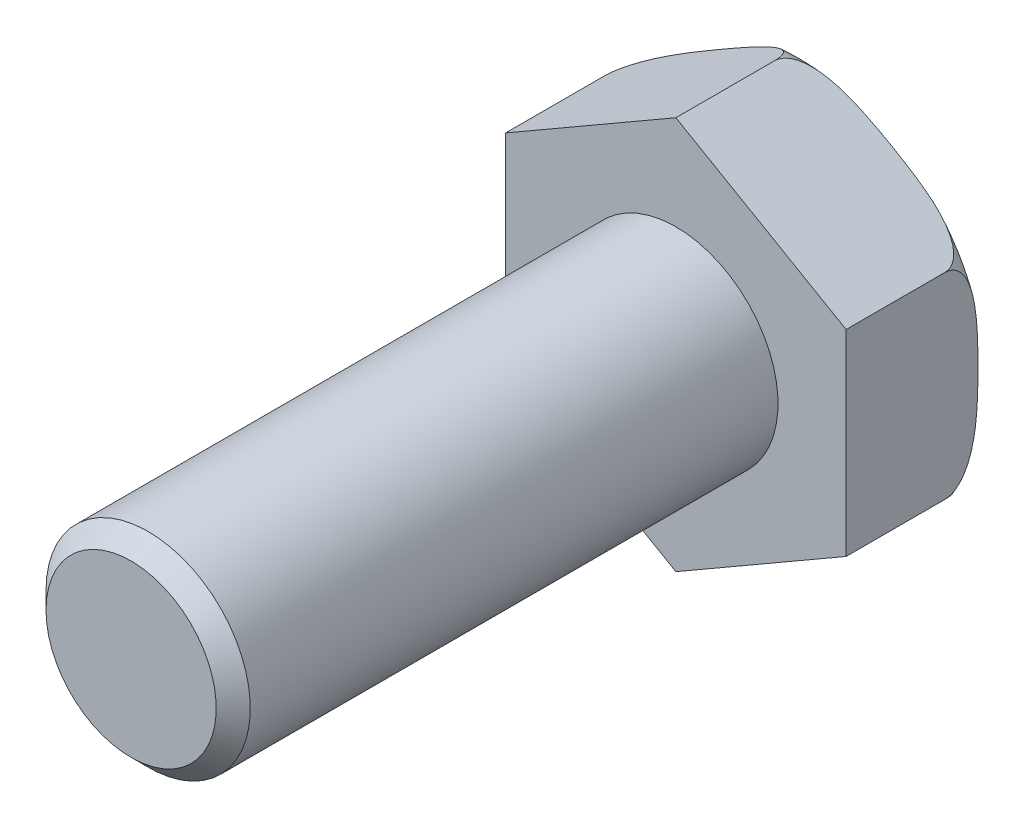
ISO-10303-21;
HEADER;
FILE_DESCRIPTION(('STEP AP214'),'2;1');
FILE_NAME('part.step','',(''),(''),'','','');
FILE_SCHEMA(('AUTOMOTIVE_DESIGN { 1 0 10303 214 1 1 1 1 }'));
ENDSEC;
DATA;
#1=APPLICATION_CONTEXT('core data for automotive mechanical design processes');
#2=APPLICATION_PROTOCOL_DEFINITION('international standard','automotive_design',2000,#1);
#3=PRODUCT_CONTEXT('',#1,'mechanical');
#4=PRODUCT('Part','Part','',(#3));
#5=PRODUCT_RELATED_PRODUCT_CATEGORY('part','',(#4));
#6=PRODUCT_DEFINITION_FORMATION('','',#4);
#7=PRODUCT_DEFINITION_CONTEXT('part definition',#1,'design');
#8=PRODUCT_DEFINITION('design','',#6,#7);
#9=PRODUCT_DEFINITION_SHAPE('','',#8);
#10=(LENGTH_UNIT() NAMED_UNIT(*) SI_UNIT(.MILLI.,.METRE.));
#11=(NAMED_UNIT(*) PLANE_ANGLE_UNIT() SI_UNIT($,.RADIAN.));
#12=(NAMED_UNIT(*) SI_UNIT($,.STERADIAN.) SOLID_ANGLE_UNIT());
#13=UNCERTAINTY_MEASURE_WITH_UNIT(LENGTH_MEASURE(1.E-05),#10,'distance_accuracy_value','');
#14=(GEOMETRIC_REPRESENTATION_CONTEXT(3) GLOBAL_UNCERTAINTY_ASSIGNED_CONTEXT((#13)) GLOBAL_UNIT_ASSIGNED_CONTEXT((#10,
#11,#12)) REPRESENTATION_CONTEXT('',''));
#15=CARTESIAN_POINT('',(0.,0.,0.));
#16=DIRECTION('',(0.,0.,1.));
#17=DIRECTION('',(1.,0.,0.));
#18=AXIS2_PLACEMENT_3D('',#15,#16,#17);
#19=CARTESIAN_POINT('',(-9.99999999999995,0.,3.9));
#20=DIRECTION('',(0.,0.,-1.));
#21=DIRECTION('',(-1.,0.,0.));
#22=AXIS2_PLACEMENT_3D('',#19,#20,#21);
#23=PLANE('',#22);
#24=DIRECTION('',(-0.866025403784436,-0.500000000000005,0.));
#25=VECTOR('',#24,1.);
#26=CARTESIAN_POINT('',(-5.,2.88675134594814,3.9));
#27=LINE('',#26,#25);
#28=CARTESIAN_POINT('',(0.,5.77350269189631,3.9));
#29=VERTEX_POINT('',#28);
#30=CARTESIAN_POINT('',(-5.,2.88675134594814,3.9));
#31=VERTEX_POINT('',#30);
#32=EDGE_CURVE('E126',#29,#31,#27,.T.);
#33=ORIENTED_EDGE('',*,*,#32,.T.);
#34=DIRECTION('',(0.,-1.,0.));
#35=VECTOR('',#34,1.);
#36=CARTESIAN_POINT('',(-5.,2.88675134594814,3.9));
#37=LINE('',#36,#35);
#38=CARTESIAN_POINT('',(-5.,-2.88675134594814,3.9));
#39=VERTEX_POINT('',#38);
#40=EDGE_CURVE('E123',#31,#39,#37,.T.);
#41=ORIENTED_EDGE('',*,*,#40,.T.);
#42=DIRECTION('',(0.866025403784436,-0.500000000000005,0.));
#43=VECTOR('',#42,1.);
#44=CARTESIAN_POINT('',(-5.,-2.88675134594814,3.9));
#45=LINE('',#44,#43);
#46=CARTESIAN_POINT('',(0.,-5.77350269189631,3.9));
#47=VERTEX_POINT('',#46);
#48=EDGE_CURVE('E199',#39,#47,#45,.T.);
#49=ORIENTED_EDGE('',*,*,#48,.T.);
#50=DIRECTION('',(0.866025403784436,0.500000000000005,0.));
#51=VECTOR('',#50,1.);
#52=CARTESIAN_POINT('',(5.,-2.88675134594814,3.9));
#53=LINE('',#52,#51);
#54=CARTESIAN_POINT('',(5.,-2.88675134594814,3.9));
#55=VERTEX_POINT('',#54);
#56=EDGE_CURVE('E200',#47,#55,#53,.T.);
#57=ORIENTED_EDGE('',*,*,#56,.T.);
#58=DIRECTION('',(0.,1.,0.));
#59=VECTOR('',#58,1.);
#60=CARTESIAN_POINT('',(5.,2.88675134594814,3.9));
#61=LINE('',#60,#59);
#62=CARTESIAN_POINT('',(5.,2.88675134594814,3.9));
#63=VERTEX_POINT('',#62);
#64=EDGE_CURVE('E202',#55,#63,#61,.T.);
#65=ORIENTED_EDGE('',*,*,#64,.T.);
#66=DIRECTION('',(-0.866025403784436,0.500000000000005,0.));
#67=VECTOR('',#66,1.);
#68=CARTESIAN_POINT('',(5.,2.88675134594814,3.9));
#69=LINE('',#68,#67);
#70=EDGE_CURVE('E56',#63,#29,#69,.T.);
#71=ORIENTED_EDGE('',*,*,#70,.T.);
#72=EDGE_LOOP('',(#33,#41,#49,#57,#65,#71));
#73=FACE_BOUND('',#72,.T.);
#74=CARTESIAN_POINT('',(0.,0.,3.9));
#75=DIRECTION('',(0.,0.,-1.));
#76=DIRECTION('',(-1.,0.,0.));
#77=AXIS2_PLACEMENT_3D('',#74,#75,#76);
#78=CIRCLE('',#77,3.);
#79=CARTESIAN_POINT('',(-3.,0.,3.9));
#80=VERTEX_POINT('',#79);
#81=EDGE_CURVE('E11',#80,#80,#78,.F.);
#82=ORIENTED_EDGE('',*,*,#81,.F.);
#83=EDGE_LOOP('',(#82));
#84=FACE_BOUND('',#83,.T.);
#85=ADVANCED_FACE('F32',(#73,#84),#23,.F.);
#86=CARTESIAN_POINT('',(-5.,2.88675134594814,3.9));
#87=DIRECTION('',(0.500000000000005,-0.866025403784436,0.));
#88=DIRECTION('',(0.866025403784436,0.500000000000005,0.));
#89=AXIS2_PLACEMENT_3D('',#86,#87,#88);
#90=PLANE('',#89);
#91=CARTESIAN_POINT('',(-4.99999996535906,2.88675136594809,1.0002));
#92=CARTESIAN_POINT('',(-5.00006907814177,2.88671146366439,0.970351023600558));
#93=CARTESIAN_POINT('',(-4.99770955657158,2.8880737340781,0.940572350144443));
#94=CARTESIAN_POINT('',(-4.98864224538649,2.89330874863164,0.882155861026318));
#95=CARTESIAN_POINT('',(-4.98197084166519,2.897160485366,0.853510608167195));
#96=CARTESIAN_POINT('',(-4.96479690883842,2.90707586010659,0.797913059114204));
#97=CARTESIAN_POINT('',(-4.95430462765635,2.91313358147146,0.770956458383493));
#98=CARTESIAN_POINT('',(-4.93013797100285,2.92708620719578,0.718976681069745));
#99=CARTESIAN_POINT('',(-4.91645660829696,2.93498514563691,0.693957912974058));
#100=CARTESIAN_POINT('',(-4.87714942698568,2.95767915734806,0.630984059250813));
#101=CARTESIAN_POINT('',(-4.84942080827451,2.97368828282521,0.594781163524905));
#102=CARTESIAN_POINT('',(-4.78944529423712,3.00831516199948,0.527781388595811));
#103=CARTESIAN_POINT('',(-4.75718692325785,3.02693954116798,0.496998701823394));
#104=CARTESIAN_POINT('',(-4.69466550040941,3.06303630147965,0.444430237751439));
#105=CARTESIAN_POINT('',(-4.66480908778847,3.08027390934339,0.421987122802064));
#106=CARTESIAN_POINT('',(-4.60352044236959,3.11565892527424,0.380156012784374));
#107=CARTESIAN_POINT('',(-4.57208700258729,3.13380703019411,0.36077040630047));
#108=CARTESIAN_POINT('',(-4.47603383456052,3.18926335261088,0.30655664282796));
#109=CARTESIAN_POINT('',(-4.40972311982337,3.22754786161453,0.275720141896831));
#110=CARTESIAN_POINT('',(-4.29385125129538,3.29444651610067,0.229686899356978));
#111=CARTESIAN_POINT('',(-4.24483560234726,3.32274571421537,0.212531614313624));
#112=CARTESIAN_POINT('',(-4.14599413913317,3.37981185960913,0.181640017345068));
#113=CARTESIAN_POINT('',(-4.09616820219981,3.40857887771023,0.167904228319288));
#114=CARTESIAN_POINT('',(-3.94573332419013,3.49543249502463,0.13083805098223));
#115=CARTESIAN_POINT('',(-3.84435655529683,3.55396239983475,0.111718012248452));
#116=CARTESIAN_POINT('',(-3.64030411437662,3.67177213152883,0.0809263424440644));
#117=CARTESIAN_POINT('',(-3.53762442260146,3.73105427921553,0.0692941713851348));
#118=CARTESIAN_POINT('',(-3.33204784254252,3.84974397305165,0.0510824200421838));
#119=CARTESIAN_POINT('',(-3.22915126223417,3.90915134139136,0.0444979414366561));
#120=CARTESIAN_POINT('',(-3.04077670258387,4.01790944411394,0.035475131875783));
#121=CARTESIAN_POINT('',(-2.95531504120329,4.06725075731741,0.032521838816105));
#122=CARTESIAN_POINT('',(-2.78434734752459,4.16595900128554,0.0282809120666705));
#123=CARTESIAN_POINT('',(-2.69884131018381,4.21532593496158,0.0269935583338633));
#124=CARTESIAN_POINT('',(-2.52814483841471,4.31387758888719,0.0257846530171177));
#125=CARTESIAN_POINT('',(-2.44295442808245,4.36306229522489,0.025857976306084));
#126=CARTESIAN_POINT('',(-2.27258757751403,4.46142364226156,0.0273803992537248));
#127=CARTESIAN_POINT('',(-2.18741113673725,4.51060028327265,0.0288294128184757));
#128=CARTESIAN_POINT('',(-1.98528038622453,4.62730052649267,0.0342759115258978));
#129=CARTESIAN_POINT('',(-1.8683399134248,4.69481613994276,0.039023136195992));
#130=CARTESIAN_POINT('',(-1.63436346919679,4.82990250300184,0.0535247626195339));
#131=CARTESIAN_POINT('',(-1.5173279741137,4.8974729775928,0.0632914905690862));
#132=CARTESIAN_POINT('',(-1.33675326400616,5.00172783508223,0.0847162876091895));
#133=CARTESIAN_POINT('',(-1.27296555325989,5.03855568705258,0.0935197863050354));
#134=CARTESIAN_POINT('',(-1.14578404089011,5.11198396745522,0.114295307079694));
#135=CARTESIAN_POINT('',(-1.0823901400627,5.1485844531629,0.126266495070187));
#136=CARTESIAN_POINT('',(-0.956487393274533,5.22127443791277,0.154209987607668));
#137=CARTESIAN_POINT('',(-0.893976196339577,5.25736529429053,0.170167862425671));
#138=CARTESIAN_POINT('',(-0.770066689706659,5.3289044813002,0.207225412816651));
#139=CARTESIAN_POINT('',(-0.708668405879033,5.36435279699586,0.228325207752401));
#140=CARTESIAN_POINT('',(-0.602471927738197,5.42566536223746,0.271203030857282));
#141=CARTESIAN_POINT('',(-0.557253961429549,5.45177196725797,0.291579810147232));
#142=CARTESIAN_POINT('',(-0.4685942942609,5.50295964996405,0.336898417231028));
#143=CARTESIAN_POINT('',(-0.425150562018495,5.52804190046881,0.361834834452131));
#144=CARTESIAN_POINT('',(-0.340527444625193,5.57689908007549,0.417513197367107));
#145=CARTESIAN_POINT('',(-0.299374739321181,5.60065860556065,0.448310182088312));
#146=CARTESIAN_POINT('',(-0.221485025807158,5.64562825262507,0.516640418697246));
#147=CARTESIAN_POINT('',(-0.184736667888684,5.66684492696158,0.554155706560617));
#148=CARTESIAN_POINT('',(-0.130841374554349,5.69796138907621,0.621239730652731));
#149=CARTESIAN_POINT('',(-0.111527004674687,5.70911254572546,0.648474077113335));
#150=CARTESIAN_POINT('',(-0.0765614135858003,5.72929993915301,0.705981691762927));
#151=CARTESIAN_POINT('',(-0.0609106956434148,5.73833588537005,0.736255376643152));
#152=CARTESIAN_POINT('',(-0.0342097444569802,5.75375168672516,0.799930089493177));
#153=CARTESIAN_POINT('',(-0.0232212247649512,5.76009591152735,0.833366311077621));
#154=CARTESIAN_POINT('',(-0.00729449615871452,5.76929121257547,0.902053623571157));
#155=CARTESIAN_POINT('',(-0.00233300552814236,5.77215573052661,0.937297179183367));
#156=CARTESIAN_POINT('',(-0.000209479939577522,5.7733817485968,0.981850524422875));
#157=CARTESIAN_POINT('',(7.65761885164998E-06,5.77350711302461,0.991027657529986));
#158=CARTESIAN_POINT('',(-3.4641018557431E-08,5.77350267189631,1.0002));
#159=B_SPLINE_CURVE_WITH_KNOTS('',3,(#91,#92,#93,#94,#95,#96,#97,#98,#99,#100,#101,#102,#103,
#104,#105,#106,#107,#108,#109,#110,#111,#112,#113,#114,#115,#116,#117,#118,#119,#120,#121,#122,
#123,#124,#125,#126,#127,#128,#129,#130,#131,#132,#133,#134,#135,#136,#137,#138,#139,#140,#141,
#142,#143,#144,#145,#146,#147,#148,#149,#150,#151,#152,#153,#154,#155,#156,#157,#158),
.UNSPECIFIED.,.F.,.F.,(4,2,2,2,2,2,2,2,2,2,2,2,2,2,2,2,2,2,2,2,2,2,2,2,2,2,2,2,2,2,2,2,2,4),(0.,
0.0893082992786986,0.177872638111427,0.266201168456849,0.354725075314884,0.498885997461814,
0.643418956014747,0.766650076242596,0.889976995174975,1.13688731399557,1.31422171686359,
1.49158322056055,1.84699035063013,2.20425541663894,2.56117334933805,2.85733875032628,
3.15355391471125,3.44865358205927,3.74373478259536,4.1490340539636,4.55533339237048,
4.77782242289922,5.00025292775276,5.22188972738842,5.44353167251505,5.61150721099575,
5.77928470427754,5.9487234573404,6.11771573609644,6.22301263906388,6.32832399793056,
6.43498888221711,6.54124040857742,6.56876759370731),.UNSPECIFIED.);
#160=CARTESIAN_POINT('',(-5.,2.88675134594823,1.));
#161=VERTEX_POINT('',#160);
#162=CARTESIAN_POINT('',(0.,5.77350269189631,1.));
#163=VERTEX_POINT('',#162);
#164=EDGE_CURVE('E48',#161,#163,#159,.T.);
#165=ORIENTED_EDGE('',*,*,#164,.F.);
#166=DIRECTION('',(0.,0.,-1.));
#167=VECTOR('',#166,1.);
#168=CARTESIAN_POINT('',(-5.,2.88675134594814,3.9));
#169=LINE('',#168,#167);
#170=EDGE_CURVE('E41',#31,#161,#169,.T.);
#171=ORIENTED_EDGE('',*,*,#170,.F.);
#172=ORIENTED_EDGE('',*,*,#32,.F.);
#173=DIRECTION('',(0.,0.,-1.));
#174=VECTOR('',#173,1.);
#175=CARTESIAN_POINT('',(0.,5.77350269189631,3.9));
#176=LINE('',#175,#174);
#177=EDGE_CURVE('E105',#29,#163,#176,.T.);
#178=ORIENTED_EDGE('',*,*,#177,.T.);
#179=EDGE_LOOP('',(#165,#171,#172,#178));
#180=FACE_BOUND('',#179,.T.);
#181=ADVANCED_FACE('F34',(#180),#90,.F.);
#182=CARTESIAN_POINT('',(-5.,2.88675134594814,3.9));
#183=DIRECTION('',(1.,0.,0.));
#184=DIRECTION('',(0.,1.,0.));
#185=AXIS2_PLACEMENT_3D('',#182,#183,#184);
#186=PLANE('',#185);
#187=CARTESIAN_POINT('',(-5.00000000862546,0.,0.0259882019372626));
#188=CARTESIAN_POINT('',(-5.00000000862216,0.08443415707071,0.0259882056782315));
#189=CARTESIAN_POINT('',(-5.00000000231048,0.168868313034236,0.026478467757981));
#190=CARTESIAN_POINT('',(-4.99999999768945,0.337726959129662,0.0285245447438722));
#191=CARTESIAN_POINT('',(-4.99999999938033,0.422151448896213,0.0300803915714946));
#192=CARTESIAN_POINT('',(-5.00000000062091,0.591137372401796,0.034517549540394));
#193=CARTESIAN_POINT('',(-5.00000000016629,0.675698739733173,0.0374015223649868));
#194=CARTESIAN_POINT('',(-4.99999999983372,0.844741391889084,0.0449265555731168));
#195=CARTESIAN_POINT('',(-4.99999999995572,0.92922268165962,0.0495674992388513));
#196=CARTESIAN_POINT('',(-5.00000000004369,1.0969070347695,0.0611430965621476));
#197=CARTESIAN_POINT('',(-5.0000000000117,1.18011217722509,0.0680464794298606));
#198=CARTESIAN_POINT('',(-4.9999999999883,1.34620524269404,0.0849436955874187));
#199=CARTESIAN_POINT('',(-4.99999999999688,1.42909322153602,0.094936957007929));
#200=CARTESIAN_POINT('',(-5.00000000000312,1.5940462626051,0.11899268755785));
#201=CARTESIAN_POINT('',(-5.00000000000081,1.67611301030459,0.133043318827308));
#202=CARTESIAN_POINT('',(-4.99999999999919,1.83912605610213,0.166512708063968));
#203=CARTESIAN_POINT('',(-4.99999999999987,1.92007326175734,0.185926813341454));
#204=CARTESIAN_POINT('',(-5.00000000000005,2.03224253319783,0.218140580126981));
#205=CARTESIAN_POINT('',(-5.00000000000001,2.0643190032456,0.227976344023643));
#206=CARTESIAN_POINT('',(-4.99999999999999,2.12805035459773,0.24894683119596));
#207=CARTESIAN_POINT('',(-4.99999999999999,2.15970514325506,0.26008183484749));
#208=CARTESIAN_POINT('',(-5.00000000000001,2.2540571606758,0.29573574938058));
#209=CARTESIAN_POINT('',(-5.,2.31595956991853,0.322453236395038));
#210=CARTESIAN_POINT('',(-5.,2.43682926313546,0.383554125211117));
#211=CARTESIAN_POINT('',(-5.,2.4957543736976,0.418022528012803));
#212=CARTESIAN_POINT('',(-5.,2.60702764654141,0.496303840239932));
#213=CARTESIAN_POINT('',(-5.,2.65940517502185,0.540072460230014));
#214=CARTESIAN_POINT('',(-5.,2.73003192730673,0.614720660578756));
#215=CARTESIAN_POINT('',(-5.,2.75252278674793,0.64157354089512));
#216=CARTESIAN_POINT('',(-5.,2.79340676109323,0.698283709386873));
#217=CARTESIAN_POINT('',(-5.,2.81180090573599,0.728140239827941));
#218=CARTESIAN_POINT('',(-5.,2.8434361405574,0.79096243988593));
#219=CARTESIAN_POINT('',(-5.,2.85661473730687,0.823960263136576));
#220=CARTESIAN_POINT('',(-5.,2.87620891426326,0.891907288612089));
#221=CARTESIAN_POINT('',(-5.,2.88263520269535,0.926853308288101));
#222=CARTESIAN_POINT('',(-5.,2.88763613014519,0.992650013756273));
#223=CARTESIAN_POINT('',(-5.,2.88713555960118,1.02343209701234));
#224=CARTESIAN_POINT('',(-5.,2.88054787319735,1.08439027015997));
#225=CARTESIAN_POINT('',(-5.,2.87445989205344,1.11456626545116));
#226=CARTESIAN_POINT('',(-5.,2.85783548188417,1.17139752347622));
#227=CARTESIAN_POINT('',(-5.,2.84763164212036,1.19815244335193));
#228=CARTESIAN_POINT('',(-5.,2.82351406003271,1.24991292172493));
#229=CARTESIAN_POINT('',(-5.,2.80959931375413,1.27491800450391));
#230=CARTESIAN_POINT('',(-5.,2.76996329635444,1.33663894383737));
#231=CARTESIAN_POINT('',(-5.,2.74202696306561,1.37193172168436));
#232=CARTESIAN_POINT('',(-5.,2.68096443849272,1.43770317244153));
#233=CARTESIAN_POINT('',(-5.,2.64782369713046,1.46816785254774));
#234=CARTESIAN_POINT('',(-5.,2.55531696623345,1.54310003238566));
#235=CARTESIAN_POINT('',(-5.,2.49291410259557,1.58378653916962));
#236=CARTESIAN_POINT('',(-5.,2.36298619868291,1.65566312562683));
#237=CARTESIAN_POINT('',(-5.,2.2954515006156,1.68683471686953));
#238=CARTESIAN_POINT('',(-5.,2.136643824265,1.75012804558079));
#239=CARTESIAN_POINT('',(-5.,2.04436780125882,1.77968696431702));
#240=CARTESIAN_POINT('',(-5.,1.85734995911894,1.82982538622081));
#241=CARTESIAN_POINT('',(-5.,1.76260346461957,1.8503863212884));
#242=CARTESIAN_POINT('',(-5.,1.57135169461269,1.88504786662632));
#243=CARTESIAN_POINT('',(-5.,1.47483905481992,1.89910642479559));
#244=CARTESIAN_POINT('',(-5.,1.28134727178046,1.92241415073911));
#245=CARTESIAN_POINT('',(-5.,1.1843685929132,1.93166738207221));
#246=CARTESIAN_POINT('',(-5.,1.0042797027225,1.94565378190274));
#247=CARTESIAN_POINT('',(-5.,0.921203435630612,1.95084856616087));
#248=CARTESIAN_POINT('',(-5.,0.754952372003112,1.95937338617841));
#249=CARTESIAN_POINT('',(-5.,0.671777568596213,1.96270328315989));
#250=CARTESIAN_POINT('',(-5.,0.505342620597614,1.96796434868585));
#251=CARTESIAN_POINT('',(-5.,0.42208245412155,1.9698947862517));
#252=CARTESIAN_POINT('',(-5.,0.255542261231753,1.97265338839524));
#253=CARTESIAN_POINT('',(-5.,0.172262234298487,1.97348152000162));
#254=CARTESIAN_POINT('',(-5.,0.0061538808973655,1.97417129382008));
#255=CARTESIAN_POINT('',(-5.,-0.0766744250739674,1.97403819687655));
#256=CARTESIAN_POINT('',(-5.,-0.242322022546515,1.9727955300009));
#257=CARTESIAN_POINT('',(-5.,-0.325141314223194,1.97168598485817));
#258=CARTESIAN_POINT('',(-5.,-0.490725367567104,1.96831113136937));
#259=CARTESIAN_POINT('',(-5.,-0.573490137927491,1.96604627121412));
#260=CARTESIAN_POINT('',(-5.,-0.738963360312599,1.96002344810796));
#261=CARTESIAN_POINT('',(-5.,-0.821671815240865,1.9562655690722));
#262=CARTESIAN_POINT('',(-5.,-0.964412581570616,1.94805178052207));
#263=CARTESIAN_POINT('',(-5.,-1.02447101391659,1.94406653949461));
#264=CARTESIAN_POINT('',(-5.,-1.14448717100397,1.93478296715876));
#265=CARTESIAN_POINT('',(-5.,-1.20444488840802,1.92948454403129));
#266=CARTESIAN_POINT('',(-5.,-1.38477128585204,1.91111950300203));
#267=CARTESIAN_POINT('',(-5.,-1.5049274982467,1.89561505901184));
#268=CARTESIAN_POINT('',(-5.,-1.70108630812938,1.86210894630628));
#269=CARTESIAN_POINT('',(-5.,-1.77756950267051,1.84696452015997));
#270=CARTESIAN_POINT('',(-5.,-1.92943257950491,1.81138581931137));
#271=CARTESIAN_POINT('',(-5.,-2.0048110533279,1.79094532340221));
#272=CARTESIAN_POINT('',(-5.,-2.15282891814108,1.74341837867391));
#273=CARTESIAN_POINT('',(-5.,-2.22548536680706,1.71638626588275));
#274=CARTESIAN_POINT('',(-5.,-2.36686500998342,1.65363055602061));
#275=CARTESIAN_POINT('',(-5.,-2.43559990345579,1.61793468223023));
#276=CARTESIAN_POINT('',(-5.,-2.54547416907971,1.54828169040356));
#277=CARTESIAN_POINT('',(-5.,-2.58848786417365,1.51731620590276));
#278=CARTESIAN_POINT('',(-5.,-2.66929603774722,1.44917088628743));
#279=CARTESIAN_POINT('',(-5.,-2.70710399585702,1.41200767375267));
#280=CARTESIAN_POINT('',(-5.,-2.76288617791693,1.34498011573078));
#281=CARTESIAN_POINT('',(-5.,-2.78318803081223,1.31706436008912));
#282=CARTESIAN_POINT('',(-5.,-2.81924698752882,1.25839410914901));
#283=CARTESIAN_POINT('',(-5.,-2.83500577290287,1.22764066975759));
#284=CARTESIAN_POINT('',(-5.,-2.86090483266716,1.16339588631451));
#285=CARTESIAN_POINT('',(-5.,-2.87097965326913,1.12987754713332));
#286=CARTESIAN_POINT('',(-5.,-2.88414570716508,1.06150306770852));
#287=CARTESIAN_POINT('',(-5.,-2.88724689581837,1.02664890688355));
#288=CARTESIAN_POINT('',(-5.,-2.88620974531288,0.962425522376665));
#289=CARTESIAN_POINT('',(-5.,-2.88310875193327,0.933034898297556));
#290=CARTESIAN_POINT('',(-5.,-2.87194542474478,0.875215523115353));
#291=CARTESIAN_POINT('',(-5.,-2.86388094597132,0.84678719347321));
#292=CARTESIAN_POINT('',(-5.,-2.84126242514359,0.785807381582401));
#293=CARTESIAN_POINT('',(-5.,-2.82570660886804,0.753630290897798));
#294=CARTESIAN_POINT('',(-5.,-2.78956800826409,0.69224752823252));
#295=CARTESIAN_POINT('',(-5.,-2.76897697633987,0.66304684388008));
#296=CARTESIAN_POINT('',(-5.,-2.71362532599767,0.594984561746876));
#297=CARTESIAN_POINT('',(-5.,-2.67671192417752,0.557887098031));
#298=CARTESIAN_POINT('',(-5.,-2.59768075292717,0.489780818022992));
#299=CARTESIAN_POINT('',(-5.,-2.55555195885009,0.458785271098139));
#300=CARTESIAN_POINT('',(-5.,-2.47293441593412,0.40527286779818));
#301=CARTESIAN_POINT('',(-5.,-2.43280320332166,0.382192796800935));
#302=CARTESIAN_POINT('',(-5.,-2.3506914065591,0.339552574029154));
#303=CARTESIAN_POINT('',(-5.00000000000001,-2.30870926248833,0.319995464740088));
#304=CARTESIAN_POINT('',(-4.99999999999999,-2.22341286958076,0.283877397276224));
#305=CARTESIAN_POINT('',(-4.99999999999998,-2.18009662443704,0.267321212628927));
#306=CARTESIAN_POINT('',(-5.00000000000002,-2.09259393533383,0.236811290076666));
#307=CARTESIAN_POINT('',(-5.00000000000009,-2.04840795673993,0.22285620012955));
#308=CARTESIAN_POINT('',(-4.99999999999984,-1.92375920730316,0.186861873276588));
#309=CARTESIAN_POINT('',(-4.99999999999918,-1.84258257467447,0.167298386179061));
#310=CARTESIAN_POINT('',(-5.00000000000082,-1.67909357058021,0.133582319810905));
#311=CARTESIAN_POINT('',(-5.00000000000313,-1.59678028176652,0.119434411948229));
#312=CARTESIAN_POINT('',(-4.99999999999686,-1.43132255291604,0.0952202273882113));
#313=CARTESIAN_POINT('',(-4.99999999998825,-1.34817637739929,0.0851661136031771));
#314=CARTESIAN_POINT('',(-5.00000000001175,-1.18156344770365,0.0681726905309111));
#315=CARTESIAN_POINT('',(-5.00000000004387,-1.09809663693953,0.0612339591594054));
#316=CARTESIAN_POINT('',(-4.99999999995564,-0.930072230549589,0.0496174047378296));
#317=CARTESIAN_POINT('',(-4.99999999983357,-0.845512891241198,0.0449657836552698));
#318=CARTESIAN_POINT('',(-5.00000000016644,-0.676313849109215,0.0374240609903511));
#319=CARTESIAN_POINT('',(-5.00000000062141,-0.591674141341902,0.0345340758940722));
#320=CARTESIAN_POINT('',(-4.99999999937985,-0.42253348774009,0.0300880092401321));
#321=CARTESIAN_POINT('',(-4.99999999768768,-0.338032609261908,0.0285292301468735));
#322=CARTESIAN_POINT('',(-5.00000000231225,-0.169021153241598,0.0264793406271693));
#323=CARTESIAN_POINT('',(-5.00000000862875,-0.0845105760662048,0.0259881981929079));
#324=CARTESIAN_POINT('',(-5.00000000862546,0.,0.0259882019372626));
#325=B_SPLINE_CURVE_WITH_KNOTS('',3,(#187,#188,#189,#190,#191,#192,#193,#194,#195,#196,#197,
#198,#199,#200,#201,#202,#203,#204,#205,#206,#207,#208,#209,#210,#211,#212,#213,#214,#215,#216,
#217,#218,#219,#220,#221,#222,#223,#224,#225,#226,#227,#228,#229,#230,#231,#232,#233,#234,#235,
#236,#237,#238,#239,#240,#241,#242,#243,#244,#245,#246,#247,#248,#249,#250,#251,#252,#253,#254,
#255,#256,#257,#258,#259,#260,#261,#262,#263,#264,#265,#266,#267,#268,#269,#270,#271,#272,#273,
#274,#275,#276,#277,#278,#279,#280,#281,#282,#283,#284,#285,#286,#287,#288,#289,#290,#291,#292,
#293,#294,#295,#296,#297,#298,#299,#300,#301,#302,#303,#304,#305,#306,#307,#308,#309,#310,#311,
#312,#313,#314,#315,#316,#317,#318,#319,#320,#321,#322,#323,#324),.UNSPECIFIED.,.T.,.F.,(4,2,2,
2,2,2,2,2,2,2,2,2,2,2,2,2,2,2,2,2,2,2,2,2,2,2,2,2,2,2,2,2,2,2,2,2,2,2,2,2,2,2,2,2,2,2,2,2,2,2,2,
2,2,2,2,2,2,2,2,2,2,2,2,2,2,2,2,2,4),(0.,0.253300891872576,0.506609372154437,0.760427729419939,
1.01422922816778,1.2646610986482,1.51504664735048,1.76470892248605,2.01415529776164,
2.1147822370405,2.21543093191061,2.41729436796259,2.62149001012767,2.82473419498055,
2.92952596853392,3.03429137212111,3.14027661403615,3.2460935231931,3.33793667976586,
3.42979406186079,3.51537131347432,3.60097174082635,3.73523193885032,3.86987440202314,
4.09209490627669,4.31474449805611,4.60471876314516,4.89528862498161,5.18771224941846,
5.4798881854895,5.72957811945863,5.97928663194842,6.22912548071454,6.47897180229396,
6.72745174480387,6.9759253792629,7.22430269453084,7.47266605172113,7.6532230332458,
7.83379264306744,8.19692973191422,8.43070260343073,8.66475133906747,8.89693237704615,
9.12838003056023,9.28695047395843,9.44510226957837,9.5483197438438,9.65149896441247,
9.75584328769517,9.86003855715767,9.94825395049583,10.036507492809,10.1431416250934,
10.2499516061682,10.4060755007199,10.5625352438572,10.7012177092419,10.8400193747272,
10.9790399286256,11.1179880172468,11.3682096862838,11.6186467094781,11.8698224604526,
12.1210447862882,12.3750817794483,12.6291355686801,12.8826733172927,13.1362034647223),.UNSPECIFIED.);
#326=CARTESIAN_POINT('',(-5.00000000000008,-2.88675134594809,1.));
#327=VERTEX_POINT('',#326);
#328=EDGE_CURVE('E122',#327,#161,#325,.T.);
#329=ORIENTED_EDGE('',*,*,#328,.F.);
#330=DIRECTION('',(0.,0.,-1.));
#331=VECTOR('',#330,1.);
#332=CARTESIAN_POINT('',(-5.,-2.88675134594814,3.9));
#333=LINE('',#332,#331);
#334=EDGE_CURVE('E114',#39,#327,#333,.T.);
#335=ORIENTED_EDGE('',*,*,#334,.F.);
#336=ORIENTED_EDGE('',*,*,#40,.F.);
#337=ORIENTED_EDGE('',*,*,#170,.T.);
#338=EDGE_LOOP('',(#329,#335,#336,#337));
#339=FACE_BOUND('',#338,.T.);
#340=ADVANCED_FACE('F120',(#339),#186,.F.);
#341=CARTESIAN_POINT('',(-5.,-2.88675134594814,3.9));
#342=DIRECTION('',(0.500000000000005,0.866025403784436,0.));
#343=DIRECTION('',(-0.866025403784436,0.500000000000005,0.));
#344=AXIS2_PLACEMENT_3D('',#341,#342,#343);
#345=PLANE('',#344);
#346=CARTESIAN_POINT('',(-3.46410174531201E-08,-5.77350267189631,1.0002));
#347=CARTESIAN_POINT('',(6.90781416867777E-05,-5.77354257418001,0.970351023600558));
#348=CARTESIAN_POINT('',(-0.00229044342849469,-5.7721803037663,0.940572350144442));
#349=CARTESIAN_POINT('',(-0.011357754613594,-5.76694528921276,0.882155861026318));
#350=CARTESIAN_POINT('',(-0.0180291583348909,-5.7630935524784,0.853510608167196));
#351=CARTESIAN_POINT('',(-0.035203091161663,-5.75317817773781,0.797913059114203));
#352=CARTESIAN_POINT('',(-0.0456953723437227,-5.74712045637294,0.770956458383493));
#353=CARTESIAN_POINT('',(-0.0698620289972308,-5.73316783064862,0.718976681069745));
#354=CARTESIAN_POINT('',(-0.083543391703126,-5.72526889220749,0.693957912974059));
#355=CARTESIAN_POINT('',(-0.122850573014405,-5.70257488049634,0.630984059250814));
#356=CARTESIAN_POINT('',(-0.150579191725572,-5.68656575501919,0.594781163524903));
#357=CARTESIAN_POINT('',(-0.21055470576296,-5.65193887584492,0.527781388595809));
#358=CARTESIAN_POINT('',(-0.24281307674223,-5.63331449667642,0.496998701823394));
#359=CARTESIAN_POINT('',(-0.305334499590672,-5.59721773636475,0.44443023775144));
#360=CARTESIAN_POINT('',(-0.335190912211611,-5.57998012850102,0.421987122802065));
#361=CARTESIAN_POINT('',(-0.396479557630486,-5.54459511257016,0.380156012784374));
#362=CARTESIAN_POINT('',(-0.427912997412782,-5.52644700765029,0.360770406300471));
#363=CARTESIAN_POINT('',(-0.523966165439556,-5.47099068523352,0.306556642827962));
#364=CARTESIAN_POINT('',(-0.590276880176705,-5.43270617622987,0.275720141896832));
#365=CARTESIAN_POINT('',(-0.706148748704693,-5.36580752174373,0.229686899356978));
#366=CARTESIAN_POINT('',(-0.755164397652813,-5.33750832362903,0.212531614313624));
#367=CARTESIAN_POINT('',(-0.854005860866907,-5.28044217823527,0.181640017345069));
#368=CARTESIAN_POINT('',(-0.903831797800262,-5.25167516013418,0.167904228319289));
#369=CARTESIAN_POINT('',(-1.05426667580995,-5.16482154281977,0.130838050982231));
#370=CARTESIAN_POINT('',(-1.15564344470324,-5.10629163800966,0.111718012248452));
#371=CARTESIAN_POINT('',(-1.35969588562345,-4.98848190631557,0.0809263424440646));
#372=CARTESIAN_POINT('',(-1.46237557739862,-4.92919975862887,0.0692941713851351));
#373=CARTESIAN_POINT('',(-1.66795215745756,-4.81051006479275,0.0510824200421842));
#374=CARTESIAN_POINT('',(-1.77084873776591,-4.75110269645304,0.0444979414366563));
#375=CARTESIAN_POINT('',(-1.95922329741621,-4.64234459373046,0.0354751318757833));
#376=CARTESIAN_POINT('',(-2.04468495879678,-4.59300328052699,0.0325218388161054));
#377=CARTESIAN_POINT('',(-2.21565265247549,-4.49429503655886,0.0282809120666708));
#378=CARTESIAN_POINT('',(-2.30115868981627,-4.44492810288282,0.0269935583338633));
#379=CARTESIAN_POINT('',(-2.47185516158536,-4.34637644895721,0.0257846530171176));
#380=CARTESIAN_POINT('',(-2.55704557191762,-4.29719174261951,0.025857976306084));
#381=CARTESIAN_POINT('',(-2.72741242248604,-4.19883039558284,0.0273803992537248));
#382=CARTESIAN_POINT('',(-2.81258886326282,-4.14965375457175,0.0288294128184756));
#383=CARTESIAN_POINT('',(-3.01471961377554,-4.03295351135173,0.0342759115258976));
#384=CARTESIAN_POINT('',(-3.13166008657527,-3.96543789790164,0.0390231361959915));
#385=CARTESIAN_POINT('',(-3.36563653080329,-3.83035153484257,0.0535247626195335));
#386=CARTESIAN_POINT('',(-3.48267202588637,-3.7627810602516,0.0632914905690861));
#387=CARTESIAN_POINT('',(-3.66324673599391,-3.65852620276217,0.0847162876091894));
#388=CARTESIAN_POINT('',(-3.72703444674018,-3.62169835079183,0.0935197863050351));
#389=CARTESIAN_POINT('',(-3.85421595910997,-3.54827007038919,0.114295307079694));
#390=CARTESIAN_POINT('',(-3.91760985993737,-3.5116695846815,0.126266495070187));
#391=CARTESIAN_POINT('',(-4.04351260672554,-3.43897959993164,0.154209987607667));
#392=CARTESIAN_POINT('',(-4.1060238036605,-3.40288874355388,0.17016786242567));
#393=CARTESIAN_POINT('',(-4.22993331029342,-3.33134955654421,0.20722541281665));
#394=CARTESIAN_POINT('',(-4.29133159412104,-3.29590124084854,0.228325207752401));
#395=CARTESIAN_POINT('',(-4.39752807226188,-3.23458867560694,0.271203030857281));
#396=CARTESIAN_POINT('',(-4.44274603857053,-3.20848207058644,0.291579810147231));
#397=CARTESIAN_POINT('',(-4.53140570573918,-3.15729438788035,0.336898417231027));
#398=CARTESIAN_POINT('',(-4.57484943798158,-3.1322121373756,0.36183483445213));
#399=CARTESIAN_POINT('',(-4.65947255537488,-3.08335495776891,0.417513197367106));
#400=CARTESIAN_POINT('',(-4.70062526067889,-3.05959543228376,0.44831018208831));
#401=CARTESIAN_POINT('',(-4.77851497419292,-3.01462578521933,0.516640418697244));
#402=CARTESIAN_POINT('',(-4.81526333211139,-2.99340911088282,0.554155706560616));
#403=CARTESIAN_POINT('',(-4.86915862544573,-2.96229264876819,0.62123973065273));
#404=CARTESIAN_POINT('',(-4.88847299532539,-2.95114149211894,0.648474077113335));
#405=CARTESIAN_POINT('',(-4.92343858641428,-2.9309540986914,0.705981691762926));
#406=CARTESIAN_POINT('',(-4.93908930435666,-2.92191815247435,0.736255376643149));
#407=CARTESIAN_POINT('',(-4.9657902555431,-2.90650235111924,0.799930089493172));
#408=CARTESIAN_POINT('',(-4.97677877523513,-2.90015812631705,0.833366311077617));
#409=CARTESIAN_POINT('',(-4.99270550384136,-2.89096282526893,0.902053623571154));
#410=CARTESIAN_POINT('',(-4.99766699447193,-2.88809830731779,0.937297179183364));
#411=CARTESIAN_POINT('',(-4.9997905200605,-2.8868722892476,0.981850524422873));
#412=CARTESIAN_POINT('',(-5.00000765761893,-2.88674692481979,0.991027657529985));
#413=CARTESIAN_POINT('',(-4.99999996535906,-2.88675136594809,1.0002));
#414=B_SPLINE_CURVE_WITH_KNOTS('',3,(#346,#347,#348,#349,#350,#351,#352,#353,#354,#355,#356,
#357,#358,#359,#360,#361,#362,#363,#364,#365,#366,#367,#368,#369,#370,#371,#372,#373,#374,#375,
#376,#377,#378,#379,#380,#381,#382,#383,#384,#385,#386,#387,#388,#389,#390,#391,#392,#393,#394,
#395,#396,#397,#398,#399,#400,#401,#402,#403,#404,#405,#406,#407,#408,#409,#410,#411,#412,#413),
.UNSPECIFIED.,.F.,.F.,(4,2,2,2,2,2,2,2,2,2,2,2,2,2,2,2,2,2,2,2,2,2,2,2,2,2,2,2,2,2,2,2,2,4),(0.,
0.0893082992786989,0.177872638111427,0.266201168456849,0.354725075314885,0.498885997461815,
0.643418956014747,0.766650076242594,0.889976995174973,1.13688731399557,1.31422171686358,
1.49158322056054,1.84699035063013,2.20425541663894,2.56117334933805,2.85733875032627,
3.15355391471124,3.44865358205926,3.74373478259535,4.14903405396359,4.55533339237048,
4.77782242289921,5.00025292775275,5.22188972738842,5.44353167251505,5.61150721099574,
5.77928470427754,5.9487234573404,6.11771573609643,6.22301263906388,6.32832399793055,
6.4349888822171,6.54124040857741,6.56876759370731),.UNSPECIFIED.);
#415=CARTESIAN_POINT('',(0.,-5.77350269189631,1.));
#416=VERTEX_POINT('',#415);
#417=EDGE_CURVE('E129',#416,#327,#414,.T.);
#418=ORIENTED_EDGE('',*,*,#417,.F.);
#419=DIRECTION('',(0.,0.,-1.));
#420=VECTOR('',#419,1.);
#421=CARTESIAN_POINT('',(0.,-5.77350269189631,3.9));
#422=LINE('',#421,#420);
#423=EDGE_CURVE('E107',#47,#416,#422,.T.);
#424=ORIENTED_EDGE('',*,*,#423,.F.);
#425=ORIENTED_EDGE('',*,*,#48,.F.);
#426=ORIENTED_EDGE('',*,*,#334,.T.);
#427=EDGE_LOOP('',(#418,#424,#425,#426));
#428=FACE_BOUND('',#427,.T.);
#429=ADVANCED_FACE('F170',(#428),#345,.F.);
#430=CARTESIAN_POINT('',(5.,-2.88675134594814,3.9));
#431=DIRECTION('',(-0.500000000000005,0.866025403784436,0.));
#432=DIRECTION('',(-0.866025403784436,-0.500000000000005,0.));
#433=AXIS2_PLACEMENT_3D('',#430,#431,#432);
#434=PLANE('',#433);
#435=CARTESIAN_POINT('',(4.99999996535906,-2.8867513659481,1.0002));
#436=CARTESIAN_POINT('',(5.00006907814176,-2.8867114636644,0.970351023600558));
#437=CARTESIAN_POINT('',(4.99770955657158,-2.8880737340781,0.940572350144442));
#438=CARTESIAN_POINT('',(4.98864224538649,-2.89330874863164,0.882155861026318));
#439=CARTESIAN_POINT('',(4.98197084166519,-2.89716048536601,0.853510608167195));
#440=CARTESIAN_POINT('',(4.96479690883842,-2.90707586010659,0.797913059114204));
#441=CARTESIAN_POINT('',(4.95430462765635,-2.91313358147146,0.770956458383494));
#442=CARTESIAN_POINT('',(4.93013797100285,-2.92708620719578,0.718976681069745));
#443=CARTESIAN_POINT('',(4.91645660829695,-2.93498514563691,0.693957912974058));
#444=CARTESIAN_POINT('',(4.87714942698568,-2.95767915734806,0.630984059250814));
#445=CARTESIAN_POINT('',(4.84942080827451,-2.97368828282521,0.594781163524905));
#446=CARTESIAN_POINT('',(4.78944529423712,-3.00831516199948,0.527781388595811));
#447=CARTESIAN_POINT('',(4.75718692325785,-3.02693954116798,0.496998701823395));
#448=CARTESIAN_POINT('',(4.69466550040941,-3.06303630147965,0.44443023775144));
#449=CARTESIAN_POINT('',(4.66480908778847,-3.08027390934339,0.421987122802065));
#450=CARTESIAN_POINT('',(4.60352044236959,-3.11565892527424,0.380156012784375));
#451=CARTESIAN_POINT('',(4.5720870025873,-3.13380703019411,0.360770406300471));
#452=CARTESIAN_POINT('',(4.47603383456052,-3.18926335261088,0.306556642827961));
#453=CARTESIAN_POINT('',(4.40972311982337,-3.22754786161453,0.275720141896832));
#454=CARTESIAN_POINT('',(4.29385125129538,-3.29444651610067,0.229686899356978));
#455=CARTESIAN_POINT('',(4.24483560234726,-3.32274571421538,0.212531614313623));
#456=CARTESIAN_POINT('',(4.14599413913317,-3.37981185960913,0.181640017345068));
#457=CARTESIAN_POINT('',(4.09616820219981,-3.40857887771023,0.167904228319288));
#458=CARTESIAN_POINT('',(3.94573332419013,-3.49543249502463,0.13083805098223));
#459=CARTESIAN_POINT('',(3.84435655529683,-3.55396239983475,0.111718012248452));
#460=CARTESIAN_POINT('',(3.64030411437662,-3.67177213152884,0.0809263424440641));
#461=CARTESIAN_POINT('',(3.53762442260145,-3.73105427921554,0.0692941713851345));
#462=CARTESIAN_POINT('',(3.33204784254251,-3.84974397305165,0.0510824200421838));
#463=CARTESIAN_POINT('',(3.22915126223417,-3.90915134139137,0.0444979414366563));
#464=CARTESIAN_POINT('',(3.04077670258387,-4.01790944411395,0.0354751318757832));
#465=CARTESIAN_POINT('',(2.95531504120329,-4.06725075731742,0.032521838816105));
#466=CARTESIAN_POINT('',(2.78434734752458,-4.16595900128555,0.0282809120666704));
#467=CARTESIAN_POINT('',(2.69884131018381,-4.21532593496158,0.0269935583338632));
#468=CARTESIAN_POINT('',(2.52814483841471,-4.31387758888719,0.0257846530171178));
#469=CARTESIAN_POINT('',(2.44295442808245,-4.3630622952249,0.0258579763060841));
#470=CARTESIAN_POINT('',(2.27258757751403,-4.46142364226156,0.0273803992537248));
#471=CARTESIAN_POINT('',(2.18741113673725,-4.51060028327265,0.0288294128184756));
#472=CARTESIAN_POINT('',(1.98528038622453,-4.62730052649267,0.0342759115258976));
#473=CARTESIAN_POINT('',(1.8683399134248,-4.69481613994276,0.0390231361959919));
#474=CARTESIAN_POINT('',(1.63436346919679,-4.82990250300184,0.0535247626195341));
#475=CARTESIAN_POINT('',(1.5173279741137,-4.8974729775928,0.0632914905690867));
#476=CARTESIAN_POINT('',(1.33675326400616,-5.00172783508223,0.08471628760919));
#477=CARTESIAN_POINT('',(1.2729655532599,-5.03855568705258,0.0935197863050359));
#478=CARTESIAN_POINT('',(1.14578404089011,-5.11198396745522,0.114295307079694));
#479=CARTESIAN_POINT('',(1.08239014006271,-5.1485844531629,0.126266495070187));
#480=CARTESIAN_POINT('',(0.956487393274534,-5.22127443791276,0.154209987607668));
#481=CARTESIAN_POINT('',(0.893976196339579,-5.25736529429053,0.170167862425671));
#482=CARTESIAN_POINT('',(0.770066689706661,-5.3289044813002,0.207225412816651));
#483=CARTESIAN_POINT('',(0.708668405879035,-5.36435279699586,0.228325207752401));
#484=CARTESIAN_POINT('',(0.602471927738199,-5.42566536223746,0.271203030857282));
#485=CARTESIAN_POINT('',(0.557253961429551,-5.45177196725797,0.291579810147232));
#486=CARTESIAN_POINT('',(0.468594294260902,-5.50295964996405,0.336898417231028));
#487=CARTESIAN_POINT('',(0.425150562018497,-5.52804190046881,0.361834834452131));
#488=CARTESIAN_POINT('',(0.340527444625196,-5.57689908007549,0.417513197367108));
#489=CARTESIAN_POINT('',(0.299374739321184,-5.60065860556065,0.448310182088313));
#490=CARTESIAN_POINT('',(0.22148502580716,-5.64562825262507,0.516640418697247));
#491=CARTESIAN_POINT('',(0.184736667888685,-5.66684492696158,0.554155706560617));
#492=CARTESIAN_POINT('',(0.130841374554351,-5.69796138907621,0.621239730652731));
#493=CARTESIAN_POINT('',(0.11152700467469,-5.70911254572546,0.648474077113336));
#494=CARTESIAN_POINT('',(0.0765614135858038,-5.72929993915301,0.705981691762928));
#495=CARTESIAN_POINT('',(0.0609106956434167,-5.73833588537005,0.736255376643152));
#496=CARTESIAN_POINT('',(0.034209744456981,-5.75375168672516,0.799930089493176));
#497=CARTESIAN_POINT('',(0.0232212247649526,-5.76009591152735,0.83336631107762));
#498=CARTESIAN_POINT('',(0.00729449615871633,-5.76929121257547,0.902053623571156));
#499=CARTESIAN_POINT('',(0.0023330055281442,-5.77215573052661,0.937297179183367));
#500=CARTESIAN_POINT('',(0.000209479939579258,-5.7733817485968,0.981850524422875));
#501=CARTESIAN_POINT('',(-7.65761884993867E-06,-5.77350711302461,0.991027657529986));
#502=CARTESIAN_POINT('',(3.46410202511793E-08,-5.77350267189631,1.0002));
#503=B_SPLINE_CURVE_WITH_KNOTS('',3,(#435,#436,#437,#438,#439,#440,#441,#442,#443,#444,#445,
#446,#447,#448,#449,#450,#451,#452,#453,#454,#455,#456,#457,#458,#459,#460,#461,#462,#463,#464,
#465,#466,#467,#468,#469,#470,#471,#472,#473,#474,#475,#476,#477,#478,#479,#480,#481,#482,#483,
#484,#485,#486,#487,#488,#489,#490,#491,#492,#493,#494,#495,#496,#497,#498,#499,#500,#501,#502),
.UNSPECIFIED.,.F.,.F.,(4,2,2,2,2,2,2,2,2,2,2,2,2,2,2,2,2,2,2,2,2,2,2,2,2,2,2,2,2,2,2,2,2,4),(0.,
0.0893082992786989,0.177872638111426,0.266201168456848,0.354725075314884,0.498885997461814,
0.643418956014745,0.766650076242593,0.889976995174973,1.13688731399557,1.31422171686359,
1.49158322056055,1.84699035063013,2.20425541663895,2.56117334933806,2.85733875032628,
3.15355391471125,3.44865358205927,3.74373478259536,4.1490340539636,4.55533339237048,
4.77782242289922,5.00025292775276,5.22188972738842,5.44353167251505,5.61150721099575,
5.77928470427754,5.9487234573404,6.11771573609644,6.22301263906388,6.32832399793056,
6.43498888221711,6.54124040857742,6.56876759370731),.UNSPECIFIED.);
#504=CARTESIAN_POINT('',(5.,-2.88675134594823,1.));
#505=VERTEX_POINT('',#504);
#506=EDGE_CURVE('E102',#505,#416,#503,.T.);
#507=ORIENTED_EDGE('',*,*,#506,.F.);
#508=DIRECTION('',(0.,0.,-1.));
#509=VECTOR('',#508,1.);
#510=CARTESIAN_POINT('',(5.,-2.88675134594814,3.9));
#511=LINE('',#510,#509);
#512=EDGE_CURVE('E101',#55,#505,#511,.T.);
#513=ORIENTED_EDGE('',*,*,#512,.F.);
#514=ORIENTED_EDGE('',*,*,#56,.F.);
#515=ORIENTED_EDGE('',*,*,#423,.T.);
#516=EDGE_LOOP('',(#507,#513,#514,#515));
#517=FACE_BOUND('',#516,.T.);
#518=ADVANCED_FACE('F173',(#517),#434,.F.);
#519=CARTESIAN_POINT('',(5.,2.88675134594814,3.9));
#520=DIRECTION('',(-1.,0.,0.));
#521=DIRECTION('',(0.,-1.,0.));
#522=AXIS2_PLACEMENT_3D('',#519,#520,#521);
#523=PLANE('',#522);
#524=CARTESIAN_POINT('',(5.00000000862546,0.,0.0259882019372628));
#525=CARTESIAN_POINT('',(5.00000000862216,-0.0844341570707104,0.0259882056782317));
#526=CARTESIAN_POINT('',(5.00000000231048,-0.168868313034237,0.0264784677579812));
#527=CARTESIAN_POINT('',(4.99999999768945,-0.337726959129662,0.0285245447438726));
#528=CARTESIAN_POINT('',(4.99999999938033,-0.422151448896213,0.030080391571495));
#529=CARTESIAN_POINT('',(5.00000000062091,-0.591137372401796,0.0345175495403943));
#530=CARTESIAN_POINT('',(5.0000000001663,-0.675698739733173,0.0374015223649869));
#531=CARTESIAN_POINT('',(4.99999999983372,-0.844741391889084,0.0449265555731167));
#532=CARTESIAN_POINT('',(4.99999999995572,-0.92922268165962,0.0495674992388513));
#533=CARTESIAN_POINT('',(5.00000000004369,-1.0969070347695,0.0611430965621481));
#534=CARTESIAN_POINT('',(5.0000000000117,-1.18011217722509,0.0680464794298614));
#535=CARTESIAN_POINT('',(4.9999999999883,-1.34620524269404,0.0849436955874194));
#536=CARTESIAN_POINT('',(4.99999999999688,-1.42909322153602,0.0949369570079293));
#537=CARTESIAN_POINT('',(5.00000000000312,-1.59404626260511,0.118992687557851));
#538=CARTESIAN_POINT('',(5.00000000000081,-1.67611301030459,0.133043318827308));
#539=CARTESIAN_POINT('',(4.99999999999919,-1.83912605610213,0.166512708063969));
#540=CARTESIAN_POINT('',(4.99999999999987,-1.92007326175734,0.185926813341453));
#541=CARTESIAN_POINT('',(5.00000000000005,-2.03224253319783,0.218140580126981));
#542=CARTESIAN_POINT('',(5.00000000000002,-2.0643190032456,0.227976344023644));
#543=CARTESIAN_POINT('',(4.99999999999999,-2.12805035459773,0.248946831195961));
#544=CARTESIAN_POINT('',(5.,-2.15970514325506,0.260081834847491));
#545=CARTESIAN_POINT('',(5.00000000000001,-2.2540571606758,0.29573574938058));
#546=CARTESIAN_POINT('',(5.,-2.31595956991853,0.322453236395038));
#547=CARTESIAN_POINT('',(5.,-2.43682926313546,0.383554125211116));
#548=CARTESIAN_POINT('',(5.,-2.4957543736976,0.418022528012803));
#549=CARTESIAN_POINT('',(5.,-2.60702764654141,0.496303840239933));
#550=CARTESIAN_POINT('',(5.,-2.65940517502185,0.540072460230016));
#551=CARTESIAN_POINT('',(5.,-2.73003192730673,0.614720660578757));
#552=CARTESIAN_POINT('',(5.,-2.75252278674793,0.641573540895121));
#553=CARTESIAN_POINT('',(5.,-2.79340676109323,0.698283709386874));
#554=CARTESIAN_POINT('',(5.,-2.81180090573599,0.728140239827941));
#555=CARTESIAN_POINT('',(5.,-2.8434361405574,0.790962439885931));
#556=CARTESIAN_POINT('',(5.,-2.85661473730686,0.823960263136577));
#557=CARTESIAN_POINT('',(5.,-2.87620891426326,0.891907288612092));
#558=CARTESIAN_POINT('',(5.,-2.88263520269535,0.926853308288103));
#559=CARTESIAN_POINT('',(5.,-2.88763613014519,0.992650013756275));
#560=CARTESIAN_POINT('',(5.,-2.88713555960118,1.02343209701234));
#561=CARTESIAN_POINT('',(5.,-2.88054787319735,1.08439027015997));
#562=CARTESIAN_POINT('',(5.,-2.87445989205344,1.11456626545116));
#563=CARTESIAN_POINT('',(5.,-2.85783548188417,1.17139752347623));
#564=CARTESIAN_POINT('',(5.,-2.84763164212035,1.19815244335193));
#565=CARTESIAN_POINT('',(5.,-2.82351406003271,1.24991292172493));
#566=CARTESIAN_POINT('',(5.,-2.80959931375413,1.27491800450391));
#567=CARTESIAN_POINT('',(5.,-2.76996329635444,1.33663894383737));
#568=CARTESIAN_POINT('',(5.,-2.7420269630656,1.37193172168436));
#569=CARTESIAN_POINT('',(5.,-2.68096443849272,1.43770317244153));
#570=CARTESIAN_POINT('',(5.,-2.64782369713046,1.46816785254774));
#571=CARTESIAN_POINT('',(5.,-2.55531696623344,1.54310003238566));
#572=CARTESIAN_POINT('',(5.,-2.49291410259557,1.58378653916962));
#573=CARTESIAN_POINT('',(5.,-2.36298619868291,1.65566312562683));
#574=CARTESIAN_POINT('',(5.,-2.2954515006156,1.68683471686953));
#575=CARTESIAN_POINT('',(5.,-2.136643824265,1.75012804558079));
#576=CARTESIAN_POINT('',(5.,-2.04436780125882,1.77968696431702));
#577=CARTESIAN_POINT('',(5.,-1.85734995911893,1.82982538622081));
#578=CARTESIAN_POINT('',(5.,-1.76260346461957,1.8503863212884));
#579=CARTESIAN_POINT('',(5.,-1.57135169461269,1.88504786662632));
#580=CARTESIAN_POINT('',(5.,-1.47483905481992,1.89910642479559));
#581=CARTESIAN_POINT('',(5.,-1.28134727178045,1.92241415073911));
#582=CARTESIAN_POINT('',(5.,-1.18436859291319,1.93166738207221));
#583=CARTESIAN_POINT('',(5.,-1.00427970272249,1.94565378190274));
#584=CARTESIAN_POINT('',(5.,-0.921203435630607,1.95084856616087));
#585=CARTESIAN_POINT('',(5.,-0.754952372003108,1.95937338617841));
#586=CARTESIAN_POINT('',(5.,-0.67177756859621,1.96270328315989));
#587=CARTESIAN_POINT('',(5.,-0.505342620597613,1.96796434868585));
#588=CARTESIAN_POINT('',(5.,-0.42208245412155,1.9698947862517));
#589=CARTESIAN_POINT('',(5.,-0.255542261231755,1.97265338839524));
#590=CARTESIAN_POINT('',(5.,-0.17226223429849,1.97348152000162));
#591=CARTESIAN_POINT('',(5.,-0.00615388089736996,1.97417129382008));
#592=CARTESIAN_POINT('',(5.,0.0766744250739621,1.97403819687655));
#593=CARTESIAN_POINT('',(5.,0.242322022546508,1.9727955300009));
#594=CARTESIAN_POINT('',(5.,0.325141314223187,1.97168598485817));
#595=CARTESIAN_POINT('',(5.,0.490725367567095,1.96831113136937));
#596=CARTESIAN_POINT('',(5.,0.573490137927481,1.96604627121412));
#597=CARTESIAN_POINT('',(5.,0.738963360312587,1.96002344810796));
#598=CARTESIAN_POINT('',(5.,0.821671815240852,1.9562655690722));
#599=CARTESIAN_POINT('',(5.,0.964412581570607,1.94805178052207));
#600=CARTESIAN_POINT('',(5.,1.02447101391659,1.94406653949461));
#601=CARTESIAN_POINT('',(5.,1.14448717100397,1.93478296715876));
#602=CARTESIAN_POINT('',(5.,1.20444488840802,1.92948454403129));
#603=CARTESIAN_POINT('',(5.,1.38477128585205,1.91111950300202));
#604=CARTESIAN_POINT('',(5.,1.50492749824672,1.89561505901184));
#605=CARTESIAN_POINT('',(5.,1.7010863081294,1.86210894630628));
#606=CARTESIAN_POINT('',(5.,1.77756950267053,1.84696452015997));
#607=CARTESIAN_POINT('',(5.,1.92943257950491,1.81138581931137));
#608=CARTESIAN_POINT('',(5.,2.0048110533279,1.79094532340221));
#609=CARTESIAN_POINT('',(5.,2.15282891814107,1.74341837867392));
#610=CARTESIAN_POINT('',(5.,2.22548536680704,1.71638626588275));
#611=CARTESIAN_POINT('',(5.,2.36686500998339,1.65363055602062));
#612=CARTESIAN_POINT('',(5.,2.43559990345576,1.61793468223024));
#613=CARTESIAN_POINT('',(5.,2.54547416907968,1.54828169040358));
#614=CARTESIAN_POINT('',(5.,2.58848786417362,1.51731620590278));
#615=CARTESIAN_POINT('',(5.,2.66929603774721,1.44917088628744));
#616=CARTESIAN_POINT('',(5.,2.70710399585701,1.41200767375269));
#617=CARTESIAN_POINT('',(5.,2.76288617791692,1.34498011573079));
#618=CARTESIAN_POINT('',(5.,2.78318803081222,1.31706436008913));
#619=CARTESIAN_POINT('',(5.,2.81924698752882,1.25839410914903));
#620=CARTESIAN_POINT('',(5.,2.83500577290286,1.2276406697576));
#621=CARTESIAN_POINT('',(5.,2.86090483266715,1.16339588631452));
#622=CARTESIAN_POINT('',(5.,2.87097965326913,1.12987754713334));
#623=CARTESIAN_POINT('',(5.,2.88414570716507,1.06150306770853));
#624=CARTESIAN_POINT('',(5.,2.88724689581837,1.02664890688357));
#625=CARTESIAN_POINT('',(5.,2.88620974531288,0.962425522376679));
#626=CARTESIAN_POINT('',(5.,2.88310875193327,0.93303489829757));
#627=CARTESIAN_POINT('',(5.,2.87194542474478,0.875215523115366));
#628=CARTESIAN_POINT('',(5.,2.86388094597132,0.846787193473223));
#629=CARTESIAN_POINT('',(5.,2.84126242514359,0.785807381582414));
#630=CARTESIAN_POINT('',(5.,2.82570660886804,0.753630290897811));
#631=CARTESIAN_POINT('',(5.,2.7895680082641,0.692247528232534));
#632=CARTESIAN_POINT('',(5.,2.76897697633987,0.663046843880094));
#633=CARTESIAN_POINT('',(5.,2.71362532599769,0.59498456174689));
#634=CARTESIAN_POINT('',(5.,2.67671192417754,0.557887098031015));
#635=CARTESIAN_POINT('',(5.,2.59768075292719,0.489780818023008));
#636=CARTESIAN_POINT('',(5.,2.55555195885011,0.458785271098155));
#637=CARTESIAN_POINT('',(5.,2.47293441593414,0.405272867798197));
#638=CARTESIAN_POINT('',(5.,2.43280320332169,0.382192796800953));
#639=CARTESIAN_POINT('',(5.,2.35069140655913,0.339552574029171));
#640=CARTESIAN_POINT('',(5.00000000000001,2.30870926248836,0.319995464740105));
#641=CARTESIAN_POINT('',(4.99999999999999,2.2234128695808,0.28387739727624));
#642=CARTESIAN_POINT('',(4.99999999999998,2.18009662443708,0.267321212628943));
#643=CARTESIAN_POINT('',(5.00000000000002,2.09259393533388,0.236811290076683));
#644=CARTESIAN_POINT('',(5.00000000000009,2.04840795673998,0.222856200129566));
#645=CARTESIAN_POINT('',(4.99999999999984,1.92375920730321,0.186861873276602));
#646=CARTESIAN_POINT('',(4.99999999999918,1.84258257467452,0.167298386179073));
#647=CARTESIAN_POINT('',(5.00000000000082,1.67909357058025,0.133582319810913));
#648=CARTESIAN_POINT('',(5.00000000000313,1.59678028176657,0.119434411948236));
#649=CARTESIAN_POINT('',(4.99999999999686,1.43132255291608,0.0952202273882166));
#650=CARTESIAN_POINT('',(4.99999999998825,1.34817637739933,0.0851661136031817));
#651=CARTESIAN_POINT('',(5.00000000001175,1.18156344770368,0.0681726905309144));
#652=CARTESIAN_POINT('',(5.00000000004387,1.09809663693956,0.0612339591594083));
#653=CARTESIAN_POINT('',(4.99999999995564,0.930072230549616,0.0496174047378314));
#654=CARTESIAN_POINT('',(4.99999999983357,0.845512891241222,0.0449657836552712));
#655=CARTESIAN_POINT('',(5.00000000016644,0.676313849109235,0.037424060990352));
#656=CARTESIAN_POINT('',(5.00000000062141,0.591674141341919,0.034534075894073));
#657=CARTESIAN_POINT('',(4.99999999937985,0.422533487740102,0.0300880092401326));
#658=CARTESIAN_POINT('',(4.99999999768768,0.338032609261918,0.0285292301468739));
#659=CARTESIAN_POINT('',(5.00000000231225,0.169021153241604,0.0264793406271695));
#660=CARTESIAN_POINT('',(5.00000000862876,0.0845105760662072,0.025988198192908));
#661=CARTESIAN_POINT('',(5.00000000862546,0.,0.0259882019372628));
#662=B_SPLINE_CURVE_WITH_KNOTS('',3,(#524,#525,#526,#527,#528,#529,#530,#531,#532,#533,#534,
#535,#536,#537,#538,#539,#540,#541,#542,#543,#544,#545,#546,#547,#548,#549,#550,#551,#552,#553,
#554,#555,#556,#557,#558,#559,#560,#561,#562,#563,#564,#565,#566,#567,#568,#569,#570,#571,#572,
#573,#574,#575,#576,#577,#578,#579,#580,#581,#582,#583,#584,#585,#586,#587,#588,#589,#590,#591,
#592,#593,#594,#595,#596,#597,#598,#599,#600,#601,#602,#603,#604,#605,#606,#607,#608,#609,#610,
#611,#612,#613,#614,#615,#616,#617,#618,#619,#620,#621,#622,#623,#624,#625,#626,#627,#628,#629,
#630,#631,#632,#633,#634,#635,#636,#637,#638,#639,#640,#641,#642,#643,#644,#645,#646,#647,#648,
#649,#650,#651,#652,#653,#654,#655,#656,#657,#658,#659,#660,#661),.UNSPECIFIED.,.T.,.F.,(4,2,2,
2,2,2,2,2,2,2,2,2,2,2,2,2,2,2,2,2,2,2,2,2,2,2,2,2,2,2,2,2,2,2,2,2,2,2,2,2,2,2,2,2,2,2,2,2,2,2,2,
2,2,2,2,2,2,2,2,2,2,2,2,2,2,2,2,2,4),(0.,0.253300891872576,0.506609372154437,0.760427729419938,
1.01422922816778,1.2646610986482,1.51504664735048,1.76470892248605,2.01415529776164,
2.1147822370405,2.21543093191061,2.41729436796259,2.62149001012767,2.82473419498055,
2.92952596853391,3.03429137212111,3.14027661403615,3.2460935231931,3.33793667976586,
3.42979406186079,3.51537131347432,3.60097174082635,3.73523193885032,3.86987440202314,
4.09209490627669,4.31474449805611,4.60471876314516,4.89528862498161,5.18771224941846,
5.47988818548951,5.72957811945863,5.97928663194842,6.22912548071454,6.47897180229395,
6.72745174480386,6.97592537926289,7.22430269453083,7.47266605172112,7.6532230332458,
7.83379264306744,8.19692973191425,8.43070260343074,8.66475133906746,8.89693237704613,
9.12838003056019,9.2869504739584,9.44510226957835,9.54831974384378,9.65149896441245,
9.75584328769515,9.86003855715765,9.94825395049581,10.036507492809,10.1431416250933,
10.2499516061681,10.4060755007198,10.5625352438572,10.7012177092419,10.8400193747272,
10.9790399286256,11.1179880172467,11.3682096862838,11.618646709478,11.8698224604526,
12.1210447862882,12.3750817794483,12.6291355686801,12.8826733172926,13.1362034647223),.UNSPECIFIED.);
#663=CARTESIAN_POINT('',(5.00000000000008,2.88675134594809,1.));
#664=VERTEX_POINT('',#663);
#665=EDGE_CURVE('E87',#664,#505,#662,.T.);
#666=ORIENTED_EDGE('',*,*,#665,.F.);
#667=DIRECTION('',(0.,0.,-1.));
#668=VECTOR('',#667,1.);
#669=CARTESIAN_POINT('',(5.,2.88675134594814,3.9));
#670=LINE('',#669,#668);
#671=EDGE_CURVE('E99',#63,#664,#670,.T.);
#672=ORIENTED_EDGE('',*,*,#671,.F.);
#673=ORIENTED_EDGE('',*,*,#64,.F.);
#674=ORIENTED_EDGE('',*,*,#512,.T.);
#675=EDGE_LOOP('',(#666,#672,#673,#674));
#676=FACE_BOUND('',#675,.T.);
#677=ADVANCED_FACE('F97',(#676),#523,.F.);
#678=CARTESIAN_POINT('',(5.,2.88675134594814,3.9));
#679=DIRECTION('',(-0.500000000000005,-0.866025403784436,0.));
#680=DIRECTION('',(0.866025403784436,-0.500000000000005,0.));
#681=AXIS2_PLACEMENT_3D('',#678,#679,#680);
#682=PLANE('',#681);
#683=CARTESIAN_POINT('',(3.4641016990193E-08,5.77350267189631,1.0002));
#684=CARTESIAN_POINT('',(-6.9078141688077E-05,5.77354257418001,0.970351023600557));
#685=CARTESIAN_POINT('',(0.00229044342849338,5.7721803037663,0.940572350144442));
#686=CARTESIAN_POINT('',(0.0113577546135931,5.76694528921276,0.882155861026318));
#687=CARTESIAN_POINT('',(0.0180291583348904,5.7630935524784,0.853510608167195));
#688=CARTESIAN_POINT('',(0.0352030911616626,5.75317817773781,0.797913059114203));
#689=CARTESIAN_POINT('',(0.045695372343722,5.74712045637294,0.770956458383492));
#690=CARTESIAN_POINT('',(0.0698620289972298,5.73316783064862,0.718976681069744));
#691=CARTESIAN_POINT('',(0.0835433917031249,5.72526889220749,0.693957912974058));
#692=CARTESIAN_POINT('',(0.122850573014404,5.70257488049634,0.630984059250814));
#693=CARTESIAN_POINT('',(0.150579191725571,5.68656575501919,0.594781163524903));
#694=CARTESIAN_POINT('',(0.210554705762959,5.65193887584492,0.527781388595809));
#695=CARTESIAN_POINT('',(0.24281307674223,5.63331449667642,0.496998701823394));
#696=CARTESIAN_POINT('',(0.305334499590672,5.59721773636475,0.44443023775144));
#697=CARTESIAN_POINT('',(0.335190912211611,5.57998012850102,0.421987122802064));
#698=CARTESIAN_POINT('',(0.396479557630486,5.54459511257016,0.380156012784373));
#699=CARTESIAN_POINT('',(0.427912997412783,5.52644700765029,0.360770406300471));
#700=CARTESIAN_POINT('',(0.523966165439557,5.47099068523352,0.306556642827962));
#701=CARTESIAN_POINT('',(0.590276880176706,5.43270617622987,0.275720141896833));
#702=CARTESIAN_POINT('',(0.706148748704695,5.36580752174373,0.229686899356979));
#703=CARTESIAN_POINT('',(0.755164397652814,5.33750832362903,0.212531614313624));
#704=CARTESIAN_POINT('',(0.854005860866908,5.28044217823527,0.181640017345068));
#705=CARTESIAN_POINT('',(0.903831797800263,5.25167516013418,0.167904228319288));
#706=CARTESIAN_POINT('',(1.05426667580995,5.16482154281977,0.13083805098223));
#707=CARTESIAN_POINT('',(1.15564344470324,5.10629163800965,0.111718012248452));
#708=CARTESIAN_POINT('',(1.35969588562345,4.98848190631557,0.0809263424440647));
#709=CARTESIAN_POINT('',(1.46237557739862,4.92919975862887,0.0692941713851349));
#710=CARTESIAN_POINT('',(1.66795215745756,4.81051006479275,0.051082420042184));
#711=CARTESIAN_POINT('',(1.77084873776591,4.75110269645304,0.0444979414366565));
#712=CARTESIAN_POINT('',(1.95922329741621,4.64234459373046,0.0354751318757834));
#713=CARTESIAN_POINT('',(2.04468495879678,4.59300328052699,0.0325218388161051));
#714=CARTESIAN_POINT('',(2.21565265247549,4.49429503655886,0.0282809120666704));
#715=CARTESIAN_POINT('',(2.30115868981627,4.44492810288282,0.0269935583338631));
#716=CARTESIAN_POINT('',(2.47185516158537,4.34637644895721,0.0257846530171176));
#717=CARTESIAN_POINT('',(2.55704557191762,4.29719174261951,0.025857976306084));
#718=CARTESIAN_POINT('',(2.72741242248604,4.19883039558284,0.0273803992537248));
#719=CARTESIAN_POINT('',(2.81258886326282,4.14965375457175,0.0288294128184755));
#720=CARTESIAN_POINT('',(3.01471961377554,4.03295351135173,0.0342759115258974));
#721=CARTESIAN_POINT('',(3.13166008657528,3.96543789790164,0.0390231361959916));
#722=CARTESIAN_POINT('',(3.36563653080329,3.83035153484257,0.0535247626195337));
#723=CARTESIAN_POINT('',(3.48267202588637,3.7627810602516,0.0632914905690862));
#724=CARTESIAN_POINT('',(3.66324673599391,3.65852620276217,0.0847162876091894));
#725=CARTESIAN_POINT('',(3.72703444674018,3.62169835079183,0.0935197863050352));
#726=CARTESIAN_POINT('',(3.85421595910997,3.54827007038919,0.114295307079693));
#727=CARTESIAN_POINT('',(3.91760985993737,3.5116695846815,0.126266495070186));
#728=CARTESIAN_POINT('',(4.04351260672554,3.43897959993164,0.154209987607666));
#729=CARTESIAN_POINT('',(4.10602380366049,3.40288874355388,0.17016786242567));
#730=CARTESIAN_POINT('',(4.22993331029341,3.33134955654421,0.207225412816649));
#731=CARTESIAN_POINT('',(4.29133159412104,3.29590124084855,0.228325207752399));
#732=CARTESIAN_POINT('',(4.39752807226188,3.23458867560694,0.27120303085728));
#733=CARTESIAN_POINT('',(4.44274603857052,3.20848207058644,0.29157981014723));
#734=CARTESIAN_POINT('',(4.53140570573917,3.15729438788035,0.336898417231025));
#735=CARTESIAN_POINT('',(4.57484943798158,3.1322121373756,0.361834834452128));
#736=CARTESIAN_POINT('',(4.65947255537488,3.08335495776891,0.417513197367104));
#737=CARTESIAN_POINT('',(4.70062526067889,3.05959543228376,0.448310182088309));
#738=CARTESIAN_POINT('',(4.77851497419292,3.01462578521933,0.516640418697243));
#739=CARTESIAN_POINT('',(4.81526333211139,2.99340911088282,0.554155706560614));
#740=CARTESIAN_POINT('',(4.86915862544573,2.96229264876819,0.621239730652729));
#741=CARTESIAN_POINT('',(4.88847299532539,2.95114149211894,0.648474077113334));
#742=CARTESIAN_POINT('',(4.92343858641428,2.9309540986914,0.705981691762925));
#743=CARTESIAN_POINT('',(4.93908930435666,2.92191815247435,0.736255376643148));
#744=CARTESIAN_POINT('',(4.9657902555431,2.90650235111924,0.799930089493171));
#745=CARTESIAN_POINT('',(4.97677877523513,2.90015812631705,0.833366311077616));
#746=CARTESIAN_POINT('',(4.99270550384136,2.89096282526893,0.902053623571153));
#747=CARTESIAN_POINT('',(4.99766699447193,2.88809830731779,0.937297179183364));
#748=CARTESIAN_POINT('',(4.9997905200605,2.8868722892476,0.981850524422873));
#749=CARTESIAN_POINT('',(5.00000765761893,2.88674692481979,0.991027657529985));
#750=CARTESIAN_POINT('',(4.99999996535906,2.8867513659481,1.0002));
#751=B_SPLINE_CURVE_WITH_KNOTS('',3,(#683,#684,#685,#686,#687,#688,#689,#690,#691,#692,#693,
#694,#695,#696,#697,#698,#699,#700,#701,#702,#703,#704,#705,#706,#707,#708,#709,#710,#711,#712,
#713,#714,#715,#716,#717,#718,#719,#720,#721,#722,#723,#724,#725,#726,#727,#728,#729,#730,#731,
#732,#733,#734,#735,#736,#737,#738,#739,#740,#741,#742,#743,#744,#745,#746,#747,#748,#749,#750),
.UNSPECIFIED.,.F.,.F.,(4,2,2,2,2,2,2,2,2,2,2,2,2,2,2,2,2,2,2,2,2,2,2,2,2,2,2,2,2,2,2,2,2,4),(0.,
0.0893082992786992,0.177872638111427,0.266201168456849,0.354725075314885,0.498885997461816,
0.643418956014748,0.766650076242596,0.889976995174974,1.13688731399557,1.31422171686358,
1.49158322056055,1.84699035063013,2.20425541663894,2.56117334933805,2.85733875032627,
3.15355391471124,3.44865358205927,3.74373478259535,4.1490340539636,4.55533339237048,
4.77782242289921,5.00025292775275,5.22188972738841,5.44353167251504,5.61150721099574,
5.77928470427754,5.94872345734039,6.11771573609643,6.22301263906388,6.32832399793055,
6.43498888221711,6.54124040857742,6.56876759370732),.UNSPECIFIED.);
#752=EDGE_CURVE('E84',#163,#664,#751,.T.);
#753=ORIENTED_EDGE('',*,*,#752,.F.);
#754=ORIENTED_EDGE('',*,*,#177,.F.);
#755=ORIENTED_EDGE('',*,*,#70,.F.);
#756=ORIENTED_EDGE('',*,*,#671,.T.);
#757=EDGE_LOOP('',(#753,#754,#755,#756));
#758=FACE_BOUND('',#757,.T.);
#759=ADVANCED_FACE('F104',(#758),#682,.F.);
#760=CARTESIAN_POINT('',(0.,0.,1.));
#761=DIRECTION('',(0.,0.,1.));
#762=DIRECTION('',(1.,0.,0.));
#763=AXIS2_PLACEMENT_3D('',#760,#761,#762);
#764=TOROIDAL_SURFACE('',#763,4.77350269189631,1.);
#765=CARTESIAN_POINT('',(0.,0.,0.));
#766=DIRECTION('',(0.,0.,1.));
#767=DIRECTION('',(1.,0.,0.));
#768=AXIS2_PLACEMENT_3D('',#765,#766,#767);
#769=CIRCLE('',#768,4.77350269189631);
#770=CARTESIAN_POINT('',(4.77350269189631,0.,0.));
#771=VERTEX_POINT('',#770);
#772=EDGE_CURVE('E92',#771,#771,#769,.T.);
#773=ORIENTED_EDGE('',*,*,#772,.T.);
#774=EDGE_LOOP('',(#773));
#775=FACE_BOUND('',#774,.T.);
#776=ORIENTED_EDGE('',*,*,#164,.T.);
#777=ORIENTED_EDGE('',*,*,#752,.T.);
#778=ORIENTED_EDGE('',*,*,#665,.T.);
#779=ORIENTED_EDGE('',*,*,#506,.T.);
#780=ORIENTED_EDGE('',*,*,#417,.T.);
#781=ORIENTED_EDGE('',*,*,#328,.T.);
#782=EDGE_LOOP('',(#776,#777,#778,#779,#780,#781));
#783=FACE_BOUND('',#782,.T.);
#784=ADVANCED_FACE('F86',(#775,#783),#764,.T.);
#785=CARTESIAN_POINT('',(-9.99999999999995,0.,0.));
#786=DIRECTION('',(0.,0.,-1.));
#787=DIRECTION('',(-1.,0.,0.));
#788=AXIS2_PLACEMENT_3D('',#785,#786,#787);
#789=PLANE('',#788);
#790=ORIENTED_EDGE('',*,*,#772,.F.);
#791=EDGE_LOOP('',(#790));
#792=FACE_BOUND('',#791,.T.);
#793=ADVANCED_FACE('F143',(#792),#789,.T.);
#794=CARTESIAN_POINT('',(0.,0.,19.9));
#795=DIRECTION('',(0.,0.,-1.));
#796=DIRECTION('',(-1.,0.,0.));
#797=AXIS2_PLACEMENT_3D('',#794,#795,#796);
#798=CYLINDRICAL_SURFACE('',#797,3.);
#799=CARTESIAN_POINT('',(0.,0.,19.4));
#800=DIRECTION('',(0.,0.,-1.));
#801=DIRECTION('',(-1.,0.,0.));
#802=AXIS2_PLACEMENT_3D('',#799,#800,#801);
#803=CIRCLE('',#802,3.);
#804=CARTESIAN_POINT('',(-3.,0.,19.4));
#805=VERTEX_POINT('',#804);
#806=EDGE_CURVE('E286',#805,#805,#803,.T.);
#807=ORIENTED_EDGE('',*,*,#806,.T.);
#808=EDGE_LOOP('',(#807));
#809=FACE_BOUND('',#808,.T.);
#810=ORIENTED_EDGE('',*,*,#81,.T.);
#811=EDGE_LOOP('',(#810));
#812=FACE_BOUND('',#811,.T.);
#813=ADVANCED_FACE('F145',(#809,#812),#798,.T.);
#814=CARTESIAN_POINT('',(0.,0.,19.9));
#815=DIRECTION('',(0.,0.,-1.));
#816=DIRECTION('',(-1.,0.,0.));
#817=AXIS2_PLACEMENT_3D('',#814,#815,#816);
#818=CONICAL_SURFACE('',#817,2.5,0.785398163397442);
#819=ORIENTED_EDGE('',*,*,#806,.F.);
#820=EDGE_LOOP('',(#819));
#821=FACE_BOUND('',#820,.T.);
#822=CARTESIAN_POINT('',(0.,0.,19.9));
#823=DIRECTION('',(0.,0.,-1.));
#824=DIRECTION('',(-1.,0.,0.));
#825=AXIS2_PLACEMENT_3D('',#822,#823,#824);
#826=CIRCLE('',#825,2.5);
#827=CARTESIAN_POINT('',(-2.5,0.,19.9));
#828=VERTEX_POINT('',#827);
#829=EDGE_CURVE('E284',#828,#828,#826,.T.);
#830=ORIENTED_EDGE('',*,*,#829,.T.);
#831=EDGE_LOOP('',(#830));
#832=FACE_BOUND('',#831,.T.);
#833=ADVANCED_FACE('F240',(#821,#832),#818,.T.);
#834=CARTESIAN_POINT('',(0.,0.,19.9));
#835=DIRECTION('',(0.,0.,1.));
#836=DIRECTION('',(1.,0.,0.));
#837=AXIS2_PLACEMENT_3D('',#834,#835,#836);
#838=PLANE('',#837);
#839=ORIENTED_EDGE('',*,*,#829,.F.);
#840=EDGE_LOOP('',(#839));
#841=FACE_BOUND('',#840,.T.);
#842=ADVANCED_FACE('F245',(#841),#838,.T.);
#843=CLOSED_SHELL('',(#85,#181,#340,#429,#518,#677,#759,#784,#793,#813,#833,#842));
#844=MANIFOLD_SOLID_BREP('B2',#843);
#845=ADVANCED_BREP_SHAPE_REPRESENTATION('',(#18,#844),#14);
#846=SHAPE_DEFINITION_REPRESENTATION(#9,#845);
ENDSEC;
END-ISO-10303-21;
